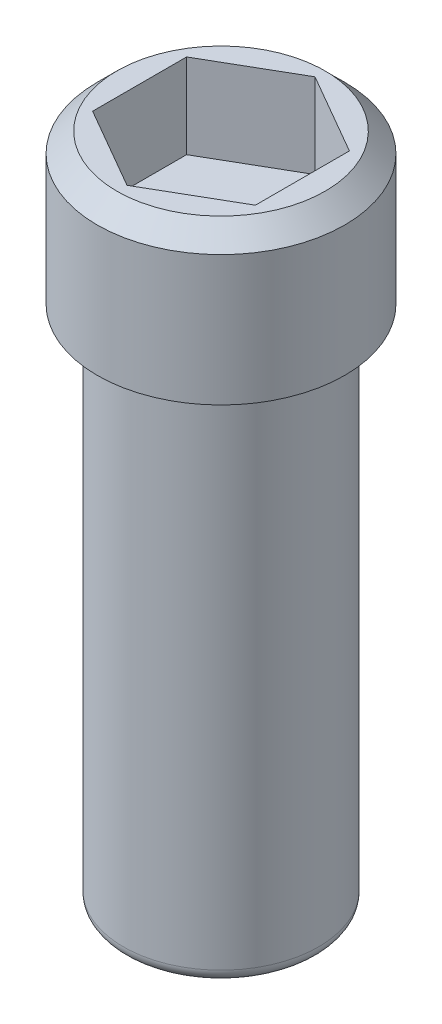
ISO-10303-21;
HEADER;
FILE_DESCRIPTION(('STEP AP214'),'2;1');
FILE_NAME('part.step','',(''),(''),'','','');
FILE_SCHEMA(('AUTOMOTIVE_DESIGN { 1 0 10303 214 1 1 1 1 }'));
ENDSEC;
DATA;
#1=APPLICATION_CONTEXT('core data for automotive mechanical design processes');
#2=APPLICATION_PROTOCOL_DEFINITION('international standard','automotive_design',2000,#1);
#3=PRODUCT_CONTEXT('',#1,'mechanical');
#4=PRODUCT('Part','Part','',(#3));
#5=PRODUCT_RELATED_PRODUCT_CATEGORY('part','',(#4));
#6=PRODUCT_DEFINITION_FORMATION('','',#4);
#7=PRODUCT_DEFINITION_CONTEXT('part definition',#1,'design');
#8=PRODUCT_DEFINITION('design','',#6,#7);
#9=PRODUCT_DEFINITION_SHAPE('','',#8);
#10=(LENGTH_UNIT() NAMED_UNIT(*) SI_UNIT(.MILLI.,.METRE.));
#11=(NAMED_UNIT(*) PLANE_ANGLE_UNIT() SI_UNIT($,.RADIAN.));
#12=(NAMED_UNIT(*) SI_UNIT($,.STERADIAN.) SOLID_ANGLE_UNIT());
#13=UNCERTAINTY_MEASURE_WITH_UNIT(LENGTH_MEASURE(1.E-05),#10,'distance_accuracy_value','');
#14=(GEOMETRIC_REPRESENTATION_CONTEXT(3) GLOBAL_UNCERTAINTY_ASSIGNED_CONTEXT((#13)) GLOBAL_UNIT_ASSIGNED_CONTEXT((#10,
#11,#12)) REPRESENTATION_CONTEXT('',''));
#15=CARTESIAN_POINT('',(0.,0.,0.));
#16=DIRECTION('',(0.,0.,1.));
#17=DIRECTION('',(1.,0.,0.));
#18=AXIS2_PLACEMENT_3D('',#15,#16,#17);
#19=CARTESIAN_POINT('',(0.,0.,0.));
#20=DIRECTION('',(0.,-1.,0.));
#21=DIRECTION('',(0.,0.,-1.));
#22=AXIS2_PLACEMENT_3D('',#19,#20,#21);
#23=PLANE('',#22);
#24=CARTESIAN_POINT('',(0.,0.,0.));
#25=DIRECTION('',(0.,-1.,0.));
#26=DIRECTION('',(0.,0.,-1.));
#27=AXIS2_PLACEMENT_3D('',#24,#25,#26);
#28=CIRCLE('',#27,1.3);
#29=CARTESIAN_POINT('',(0.,0.,-1.3));
#30=VERTEX_POINT('',#29);
#31=EDGE_CURVE('E151',#30,#30,#28,.T.);
#32=ORIENTED_EDGE('',*,*,#31,.T.);
#33=EDGE_LOOP('',(#32));
#34=FACE_BOUND('',#33,.T.);
#35=ADVANCED_FACE('F38',(#34),#23,.T.);
#36=CARTESIAN_POINT('',(0.,0.,0.));
#37=DIRECTION('',(0.,-1.,0.));
#38=DIRECTION('',(0.,0.,-1.));
#39=AXIS2_PLACEMENT_3D('',#36,#37,#38);
#40=CYLINDRICAL_SURFACE('',#39,1.5);
#41=CARTESIAN_POINT('',(0.,0.2,0.));
#42=DIRECTION('',(0.,-1.,0.));
#43=DIRECTION('',(0.,0.,-1.));
#44=AXIS2_PLACEMENT_3D('',#41,#42,#43);
#45=CIRCLE('',#44,1.5);
#46=CARTESIAN_POINT('',(0.,0.2,-1.5));
#47=VERTEX_POINT('',#46);
#48=EDGE_CURVE('E154',#47,#47,#45,.F.);
#49=ORIENTED_EDGE('',*,*,#48,.T.);
#50=EDGE_LOOP('',(#49));
#51=FACE_BOUND('',#50,.T.);
#52=CARTESIAN_POINT('',(0.,8.,0.));
#53=DIRECTION('',(0.,-1.,0.));
#54=DIRECTION('',(0.,0.,-1.));
#55=AXIS2_PLACEMENT_3D('',#52,#53,#54);
#56=CIRCLE('',#55,1.5);
#57=CARTESIAN_POINT('',(0.,8.,-1.5));
#58=VERTEX_POINT('',#57);
#59=EDGE_CURVE('E148',#58,#58,#56,.T.);
#60=ORIENTED_EDGE('',*,*,#59,.T.);
#61=EDGE_LOOP('',(#60));
#62=FACE_BOUND('',#61,.T.);
#63=ADVANCED_FACE('F174',(#51,#62),#40,.T.);
#64=CARTESIAN_POINT('',(1.5,8.,0.));
#65=DIRECTION('',(0.,-1.,0.));
#66=DIRECTION('',(0.,0.,-1.));
#67=AXIS2_PLACEMENT_3D('',#64,#65,#66);
#68=PLANE('',#67);
#69=CARTESIAN_POINT('',(0.,8.,0.));
#70=DIRECTION('',(0.,-1.,0.));
#71=DIRECTION('',(0.,0.,-1.));
#72=AXIS2_PLACEMENT_3D('',#69,#70,#71);
#73=CIRCLE('',#72,1.9);
#74=CARTESIAN_POINT('',(0.,8.,-1.9));
#75=VERTEX_POINT('',#74);
#76=EDGE_CURVE('E139',#75,#75,#73,.T.);
#77=ORIENTED_EDGE('',*,*,#76,.T.);
#78=EDGE_LOOP('',(#77));
#79=FACE_BOUND('',#78,.T.);
#80=ORIENTED_EDGE('',*,*,#59,.F.);
#81=EDGE_LOOP('',(#80));
#82=FACE_BOUND('',#81,.T.);
#83=ADVANCED_FACE('F179',(#79,#82),#68,.T.);
#84=CARTESIAN_POINT('',(0.,0.,0.));
#85=DIRECTION('',(0.,-1.,0.));
#86=DIRECTION('',(0.,0.,-1.));
#87=AXIS2_PLACEMENT_3D('',#84,#85,#86);
#88=CYLINDRICAL_SURFACE('',#87,1.9);
#89=CARTESIAN_POINT('',(0.,10.,0.));
#90=DIRECTION('',(0.,1.,0.));
#91=DIRECTION('',(0.,0.,1.));
#92=AXIS2_PLACEMENT_3D('',#89,#90,#91);
#93=CIRCLE('',#92,1.9);
#94=CARTESIAN_POINT('',(0.,10.,1.9));
#95=VERTEX_POINT('',#94);
#96=EDGE_CURVE('E45',#95,#95,#93,.F.);
#97=ORIENTED_EDGE('',*,*,#96,.T.);
#98=EDGE_LOOP('',(#97));
#99=FACE_BOUND('',#98,.T.);
#100=ORIENTED_EDGE('',*,*,#76,.F.);
#101=EDGE_LOOP('',(#100));
#102=FACE_BOUND('',#101,.T.);
#103=ADVANCED_FACE('F159',(#99,#102),#88,.T.);
#104=CARTESIAN_POINT('',(1.9,10.3,0.));
#105=DIRECTION('',(0.,1.,0.));
#106=DIRECTION('',(0.,0.,1.));
#107=AXIS2_PLACEMENT_3D('',#104,#105,#106);
#108=PLANE('',#107);
#109=CARTESIAN_POINT('',(0.,10.3,0.));
#110=DIRECTION('',(0.,1.,0.));
#111=DIRECTION('',(0.,0.,1.));
#112=AXIS2_PLACEMENT_3D('',#109,#110,#111);
#113=CIRCLE('',#112,1.6);
#114=CARTESIAN_POINT('',(0.,10.3,1.6));
#115=VERTEX_POINT('',#114);
#116=EDGE_CURVE('E11',#115,#115,#113,.T.);
#117=ORIENTED_EDGE('',*,*,#116,.T.);
#118=EDGE_LOOP('',(#117));
#119=FACE_BOUND('',#118,.T.);
#120=DIRECTION('',(-0.866025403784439,0.,0.5));
#121=VECTOR('',#120,1.);
#122=CARTESIAN_POINT('',(0.,10.3,-1.44337567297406));
#123=LINE('',#122,#121);
#124=CARTESIAN_POINT('',(0.,10.3,-1.44337567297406));
#125=VERTEX_POINT('',#124);
#126=CARTESIAN_POINT('',(-1.25,10.3,-0.721687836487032));
#127=VERTEX_POINT('',#126);
#128=EDGE_CURVE('E52',#125,#127,#123,.T.);
#129=ORIENTED_EDGE('',*,*,#128,.F.);
#130=DIRECTION('',(-0.866025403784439,0.,-0.5));
#131=VECTOR('',#130,1.);
#132=CARTESIAN_POINT('',(1.25,10.3,-0.721687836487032));
#133=LINE('',#132,#131);
#134=CARTESIAN_POINT('',(1.25,10.3,-0.721687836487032));
#135=VERTEX_POINT('',#134);
#136=EDGE_CURVE('E121',#135,#125,#133,.T.);
#137=ORIENTED_EDGE('',*,*,#136,.F.);
#138=DIRECTION('',(0.,0.,-1.));
#139=VECTOR('',#138,1.);
#140=CARTESIAN_POINT('',(1.25,10.3,0.721687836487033));
#141=LINE('',#140,#139);
#142=CARTESIAN_POINT('',(1.25,10.3,0.721687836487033));
#143=VERTEX_POINT('',#142);
#144=EDGE_CURVE('E115',#143,#135,#141,.T.);
#145=ORIENTED_EDGE('',*,*,#144,.F.);
#146=DIRECTION('',(0.866025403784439,0.,-0.5));
#147=VECTOR('',#146,1.);
#148=CARTESIAN_POINT('',(0.,10.3,1.44337567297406));
#149=LINE('',#148,#147);
#150=CARTESIAN_POINT('',(0.,10.3,1.44337567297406));
#151=VERTEX_POINT('',#150);
#152=EDGE_CURVE('E113',#151,#143,#149,.T.);
#153=ORIENTED_EDGE('',*,*,#152,.F.);
#154=DIRECTION('',(0.866025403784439,0.,0.5));
#155=VECTOR('',#154,1.);
#156=CARTESIAN_POINT('',(-1.25,10.3,0.721687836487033));
#157=LINE('',#156,#155);
#158=CARTESIAN_POINT('',(-1.25,10.3,0.721687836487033));
#159=VERTEX_POINT('',#158);
#160=EDGE_CURVE('E95',#159,#151,#157,.T.);
#161=ORIENTED_EDGE('',*,*,#160,.F.);
#162=DIRECTION('',(0.,0.,1.));
#163=VECTOR('',#162,1.);
#164=CARTESIAN_POINT('',(-1.25,10.3,-0.721687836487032));
#165=LINE('',#164,#163);
#166=EDGE_CURVE('E106',#127,#159,#165,.T.);
#167=ORIENTED_EDGE('',*,*,#166,.F.);
#168=EDGE_LOOP('',(#129,#137,#145,#153,#161,#167));
#169=FACE_BOUND('',#168,.T.);
#170=ADVANCED_FACE('F110',(#119,#169),#108,.T.);
#171=CARTESIAN_POINT('',(0.,0.2,0.));
#172=DIRECTION('',(0.,-1.,0.));
#173=DIRECTION('',(0.,0.,-1.));
#174=AXIS2_PLACEMENT_3D('',#171,#172,#173);
#175=TOROIDAL_SURFACE('',#174,1.3,0.2);
#176=ORIENTED_EDGE('',*,*,#48,.F.);
#177=EDGE_LOOP('',(#176));
#178=FACE_BOUND('',#177,.T.);
#179=ORIENTED_EDGE('',*,*,#31,.F.);
#180=EDGE_LOOP('',(#179));
#181=FACE_BOUND('',#180,.T.);
#182=ADVANCED_FACE('F183',(#178,#181),#175,.T.);
#183=CARTESIAN_POINT('',(0.,9.,-1.44337567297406));
#184=DIRECTION('',(-0.5,0.,-0.866025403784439));
#185=DIRECTION('',(-0.866025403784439,0.,0.5));
#186=AXIS2_PLACEMENT_3D('',#183,#184,#185);
#187=PLANE('',#186);
#188=ORIENTED_EDGE('',*,*,#128,.T.);
#189=DIRECTION('',(0.,1.,0.));
#190=VECTOR('',#189,1.);
#191=CARTESIAN_POINT('',(-1.25,9.,-0.721687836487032));
#192=LINE('',#191,#190);
#193=CARTESIAN_POINT('',(-1.25,9.,-0.721687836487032));
#194=VERTEX_POINT('',#193);
#195=EDGE_CURVE('E103',#194,#127,#192,.T.);
#196=ORIENTED_EDGE('',*,*,#195,.F.);
#197=DIRECTION('',(-0.866025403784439,0.,0.5));
#198=VECTOR('',#197,1.);
#199=CARTESIAN_POINT('',(0.,9.,-1.44337567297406));
#200=LINE('',#199,#198);
#201=CARTESIAN_POINT('',(0.,9.,-1.44337567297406));
#202=VERTEX_POINT('',#201);
#203=EDGE_CURVE('E123',#202,#194,#200,.T.);
#204=ORIENTED_EDGE('',*,*,#203,.F.);
#205=DIRECTION('',(0.,1.,0.));
#206=VECTOR('',#205,1.);
#207=CARTESIAN_POINT('',(0.,9.,-1.44337567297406));
#208=LINE('',#207,#206);
#209=EDGE_CURVE('E59',#202,#125,#208,.T.);
#210=ORIENTED_EDGE('',*,*,#209,.T.);
#211=EDGE_LOOP('',(#188,#196,#204,#210));
#212=FACE_BOUND('',#211,.T.);
#213=ADVANCED_FACE('F185',(#212),#187,.F.);
#214=CARTESIAN_POINT('',(1.25,9.,-0.721687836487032));
#215=DIRECTION('',(0.5,0.,-0.866025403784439));
#216=DIRECTION('',(-0.866025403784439,0.,-0.5));
#217=AXIS2_PLACEMENT_3D('',#214,#215,#216);
#218=PLANE('',#217);
#219=ORIENTED_EDGE('',*,*,#136,.T.);
#220=ORIENTED_EDGE('',*,*,#209,.F.);
#221=DIRECTION('',(-0.866025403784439,0.,-0.5));
#222=VECTOR('',#221,1.);
#223=CARTESIAN_POINT('',(1.25,9.,-0.721687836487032));
#224=LINE('',#223,#222);
#225=CARTESIAN_POINT('',(1.25,9.,-0.721687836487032));
#226=VERTEX_POINT('',#225);
#227=EDGE_CURVE('E135',#226,#202,#224,.T.);
#228=ORIENTED_EDGE('',*,*,#227,.F.);
#229=DIRECTION('',(0.,1.,0.));
#230=VECTOR('',#229,1.);
#231=CARTESIAN_POINT('',(1.25,9.,-0.721687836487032));
#232=LINE('',#231,#230);
#233=EDGE_CURVE('E140',#226,#135,#232,.T.);
#234=ORIENTED_EDGE('',*,*,#233,.T.);
#235=EDGE_LOOP('',(#219,#220,#228,#234));
#236=FACE_BOUND('',#235,.T.);
#237=ADVANCED_FACE('F192',(#236),#218,.F.);
#238=CARTESIAN_POINT('',(1.25,9.,0.721687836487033));
#239=DIRECTION('',(1.,0.,0.));
#240=DIRECTION('',(0.,0.,-1.));
#241=AXIS2_PLACEMENT_3D('',#238,#239,#240);
#242=PLANE('',#241);
#243=ORIENTED_EDGE('',*,*,#144,.T.);
#244=ORIENTED_EDGE('',*,*,#233,.F.);
#245=DIRECTION('',(0.,0.,-1.));
#246=VECTOR('',#245,1.);
#247=CARTESIAN_POINT('',(1.25,9.,0.721687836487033));
#248=LINE('',#247,#246);
#249=CARTESIAN_POINT('',(1.25,9.,0.721687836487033));
#250=VERTEX_POINT('',#249);
#251=EDGE_CURVE('E132',#250,#226,#248,.T.);
#252=ORIENTED_EDGE('',*,*,#251,.F.);
#253=DIRECTION('',(0.,1.,0.));
#254=VECTOR('',#253,1.);
#255=CARTESIAN_POINT('',(1.25,9.,0.721687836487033));
#256=LINE('',#255,#254);
#257=EDGE_CURVE('E142',#250,#143,#256,.T.);
#258=ORIENTED_EDGE('',*,*,#257,.T.);
#259=EDGE_LOOP('',(#243,#244,#252,#258));
#260=FACE_BOUND('',#259,.T.);
#261=ADVANCED_FACE('F253',(#260),#242,.F.);
#262=CARTESIAN_POINT('',(0.,9.,1.44337567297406));
#263=DIRECTION('',(0.5,0.,0.866025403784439));
#264=DIRECTION('',(0.866025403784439,0.,-0.5));
#265=AXIS2_PLACEMENT_3D('',#262,#263,#264);
#266=PLANE('',#265);
#267=ORIENTED_EDGE('',*,*,#152,.T.);
#268=ORIENTED_EDGE('',*,*,#257,.F.);
#269=DIRECTION('',(0.866025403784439,0.,-0.5));
#270=VECTOR('',#269,1.);
#271=CARTESIAN_POINT('',(0.,9.,1.44337567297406));
#272=LINE('',#271,#270);
#273=CARTESIAN_POINT('',(0.,9.,1.44337567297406));
#274=VERTEX_POINT('',#273);
#275=EDGE_CURVE('E129',#274,#250,#272,.T.);
#276=ORIENTED_EDGE('',*,*,#275,.F.);
#277=DIRECTION('',(0.,1.,0.));
#278=VECTOR('',#277,1.);
#279=CARTESIAN_POINT('',(0.,9.,1.44337567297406));
#280=LINE('',#279,#278);
#281=EDGE_CURVE('E102',#274,#151,#280,.T.);
#282=ORIENTED_EDGE('',*,*,#281,.T.);
#283=EDGE_LOOP('',(#267,#268,#276,#282));
#284=FACE_BOUND('',#283,.T.);
#285=ADVANCED_FACE('F245',(#284),#266,.F.);
#286=CARTESIAN_POINT('',(-1.25,9.,0.721687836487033));
#287=DIRECTION('',(-0.5,0.,0.866025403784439));
#288=DIRECTION('',(0.866025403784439,0.,0.5));
#289=AXIS2_PLACEMENT_3D('',#286,#287,#288);
#290=PLANE('',#289);
#291=ORIENTED_EDGE('',*,*,#160,.T.);
#292=ORIENTED_EDGE('',*,*,#281,.F.);
#293=DIRECTION('',(0.866025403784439,0.,0.5));
#294=VECTOR('',#293,1.);
#295=CARTESIAN_POINT('',(-1.25,9.,0.721687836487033));
#296=LINE('',#295,#294);
#297=CARTESIAN_POINT('',(-1.25,9.,0.721687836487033));
#298=VERTEX_POINT('',#297);
#299=EDGE_CURVE('E98',#298,#274,#296,.T.);
#300=ORIENTED_EDGE('',*,*,#299,.F.);
#301=DIRECTION('',(0.,1.,0.));
#302=VECTOR('',#301,1.);
#303=CARTESIAN_POINT('',(-1.25,9.,0.721687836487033));
#304=LINE('',#303,#302);
#305=EDGE_CURVE('E91',#298,#159,#304,.T.);
#306=ORIENTED_EDGE('',*,*,#305,.T.);
#307=EDGE_LOOP('',(#291,#292,#300,#306));
#308=FACE_BOUND('',#307,.T.);
#309=ADVANCED_FACE('F93',(#308),#290,.F.);
#310=CARTESIAN_POINT('',(-1.25,9.,-0.721687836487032));
#311=DIRECTION('',(-1.,0.,0.));
#312=DIRECTION('',(0.,0.,1.));
#313=AXIS2_PLACEMENT_3D('',#310,#311,#312);
#314=PLANE('',#313);
#315=ORIENTED_EDGE('',*,*,#166,.T.);
#316=ORIENTED_EDGE('',*,*,#305,.F.);
#317=DIRECTION('',(0.,0.,1.));
#318=VECTOR('',#317,1.);
#319=CARTESIAN_POINT('',(-1.25,9.,-0.721687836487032));
#320=LINE('',#319,#318);
#321=EDGE_CURVE('E126',#194,#298,#320,.T.);
#322=ORIENTED_EDGE('',*,*,#321,.F.);
#323=ORIENTED_EDGE('',*,*,#195,.T.);
#324=EDGE_LOOP('',(#315,#316,#322,#323));
#325=FACE_BOUND('',#324,.T.);
#326=ADVANCED_FACE('F107',(#325),#314,.F.);
#327=CARTESIAN_POINT('',(1.25,9.,-2.1650635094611));
#328=DIRECTION('',(0.,-1.,0.));
#329=DIRECTION('',(0.,0.,-1.));
#330=AXIS2_PLACEMENT_3D('',#327,#328,#329);
#331=PLANE('',#330);
#332=ORIENTED_EDGE('',*,*,#203,.T.);
#333=ORIENTED_EDGE('',*,*,#321,.T.);
#334=ORIENTED_EDGE('',*,*,#299,.T.);
#335=ORIENTED_EDGE('',*,*,#275,.T.);
#336=ORIENTED_EDGE('',*,*,#251,.T.);
#337=ORIENTED_EDGE('',*,*,#227,.T.);
#338=EDGE_LOOP('',(#332,#333,#334,#335,#336,#337));
#339=FACE_BOUND('',#338,.T.);
#340=ADVANCED_FACE('F164',(#339),#331,.F.);
#341=CARTESIAN_POINT('',(0.,10.,0.));
#342=DIRECTION('',(0.,-1.,0.));
#343=DIRECTION('',(0.,0.,-1.));
#344=AXIS2_PLACEMENT_3D('',#341,#342,#343);
#345=CONICAL_SURFACE('',#344,1.9,0.785398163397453);
#346=ORIENTED_EDGE('',*,*,#116,.F.);
#347=EDGE_LOOP('',(#346));
#348=FACE_BOUND('',#347,.T.);
#349=ORIENTED_EDGE('',*,*,#96,.F.);
#350=EDGE_LOOP('',(#349));
#351=FACE_BOUND('',#350,.T.);
#352=ADVANCED_FACE('F162',(#348,#351),#345,.T.);
#353=CLOSED_SHELL('',(#35,#63,#83,#103,#170,#182,#213,#237,#261,#285,#309,#326,#340,#352));
#354=MANIFOLD_SOLID_BREP('B2',#353);
#355=ADVANCED_BREP_SHAPE_REPRESENTATION('',(#18,#354),#14);
#356=SHAPE_DEFINITION_REPRESENTATION(#9,#355);
ENDSEC;
END-ISO-10303-21;
